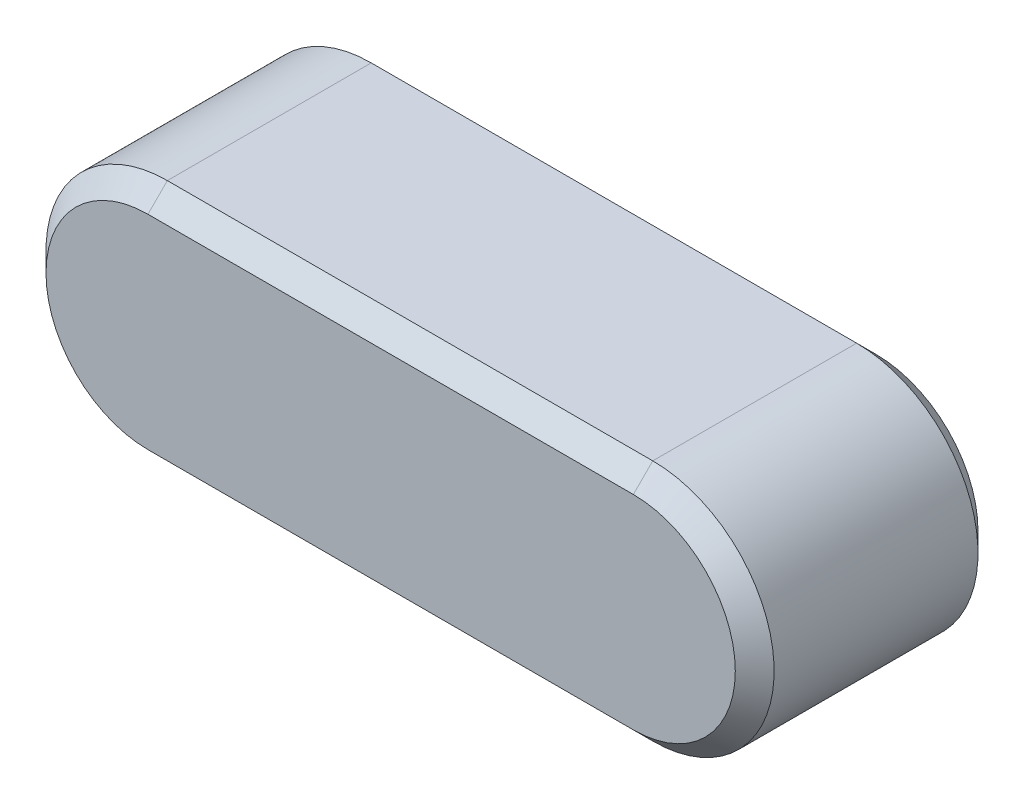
from build123d import *

# Parameters (mm, degrees)
EXTRUDE1_DEPTH = 2
CHAMFER1_SIZE  = 0.16


with BuildPart() as part:
    # Sketch1 → Extrude1 (new body)
    with BuildSketch(Plane.XY):
        with BuildLine():
            Line((0, 1), (-4, 1))
            ThreePointArc((-4, 1), (-5, 0), (-4, -1))
            Line((-4, -1), (0, -1))
            ThreePointArc((0, -1), (1, 0), (0, 1))
        make_face()
    extrude(amount=EXTRUDE1_DEPTH)

    # Chamfer1
    chamfer1_edges = [part.edges().sort_by_distance(p)[0] for p in [
        (-5, 0, 2),
        (-2, -1, 2),
        (1, 0, 2),
        (-2, -1, 0),
        (-5, 0, 0),
        (-2, 1, 0),
        (1, 0, 0),
        (-2, 1, 2),
    ]]
    chamfer(chamfer1_edges, length=CHAMFER1_SIZE)


solid = part.part
